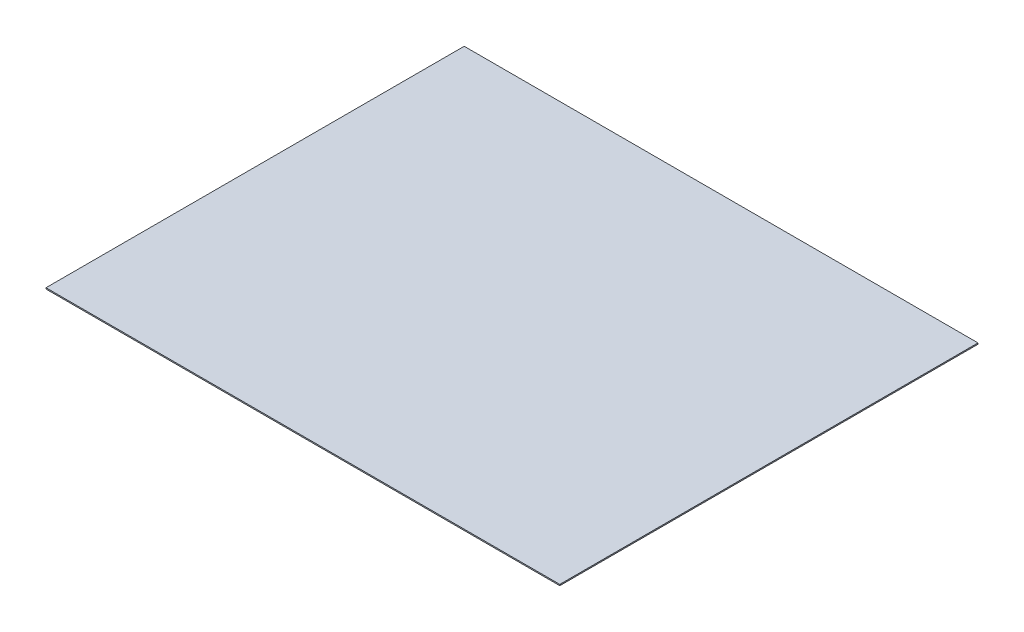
ISO-10303-21;
HEADER;
FILE_DESCRIPTION(('STEP AP214'),'2;1');
FILE_NAME('part.step','',(''),(''),'','','');
FILE_SCHEMA(('AUTOMOTIVE_DESIGN { 1 0 10303 214 1 1 1 1 }'));
ENDSEC;
DATA;
#1=APPLICATION_CONTEXT('core data for automotive mechanical design processes');
#2=APPLICATION_PROTOCOL_DEFINITION('international standard','automotive_design',2000,#1);
#3=PRODUCT_CONTEXT('',#1,'mechanical');
#4=PRODUCT('Part','Part','',(#3));
#5=PRODUCT_RELATED_PRODUCT_CATEGORY('part','',(#4));
#6=PRODUCT_DEFINITION_FORMATION('','',#4);
#7=PRODUCT_DEFINITION_CONTEXT('part definition',#1,'design');
#8=PRODUCT_DEFINITION('design','',#6,#7);
#9=PRODUCT_DEFINITION_SHAPE('','',#8);
#10=(LENGTH_UNIT() NAMED_UNIT(*) SI_UNIT(.MILLI.,.METRE.));
#11=(NAMED_UNIT(*) PLANE_ANGLE_UNIT() SI_UNIT($,.RADIAN.));
#12=(NAMED_UNIT(*) SI_UNIT($,.STERADIAN.) SOLID_ANGLE_UNIT());
#13=UNCERTAINTY_MEASURE_WITH_UNIT(LENGTH_MEASURE(1.E-05),#10,'distance_accuracy_value','');
#14=(GEOMETRIC_REPRESENTATION_CONTEXT(3) GLOBAL_UNCERTAINTY_ASSIGNED_CONTEXT((#13)) GLOBAL_UNIT_ASSIGNED_CONTEXT((#10,
#11,#12)) REPRESENTATION_CONTEXT('',''));
#15=CARTESIAN_POINT('',(0.,0.,0.));
#16=DIRECTION('',(0.,0.,1.));
#17=DIRECTION('',(1.,0.,0.));
#18=AXIS2_PLACEMENT_3D('',#15,#16,#17);
#19=CARTESIAN_POINT('',(0.,1.27,0.));
#20=DIRECTION('',(1.,0.,0.));
#21=DIRECTION('',(0.,0.,-1.));
#22=AXIS2_PLACEMENT_3D('',#19,#20,#21);
#23=PLANE('',#22);
#24=DIRECTION('',(0.,0.,1.));
#25=VECTOR('',#24,1.);
#26=CARTESIAN_POINT('',(0.,0.,0.));
#27=LINE('',#26,#25);
#28=CARTESIAN_POINT('',(0.,0.,0.));
#29=VERTEX_POINT('',#28);
#30=CARTESIAN_POINT('',(0.,0.,444.5));
#31=VERTEX_POINT('',#30);
#32=EDGE_CURVE('E100',#29,#31,#27,.T.);
#33=ORIENTED_EDGE('',*,*,#32,.T.);
#34=DIRECTION('',(0.,-1.,0.));
#35=VECTOR('',#34,1.);
#36=CARTESIAN_POINT('',(0.,1.27,444.5));
#37=LINE('',#36,#35);
#38=CARTESIAN_POINT('',(0.,1.27,444.5));
#39=VERTEX_POINT('',#38);
#40=EDGE_CURVE('E11',#39,#31,#37,.T.);
#41=ORIENTED_EDGE('',*,*,#40,.F.);
#42=DIRECTION('',(0.,0.,1.));
#43=VECTOR('',#42,1.);
#44=CARTESIAN_POINT('',(0.,1.27,0.));
#45=LINE('',#44,#43);
#46=CARTESIAN_POINT('',(0.,1.27,0.));
#47=VERTEX_POINT('',#46);
#48=EDGE_CURVE('E88',#47,#39,#45,.T.);
#49=ORIENTED_EDGE('',*,*,#48,.F.);
#50=DIRECTION('',(0.,-1.,0.));
#51=VECTOR('',#50,1.);
#52=CARTESIAN_POINT('',(0.,1.27,0.));
#53=LINE('',#52,#51);
#54=EDGE_CURVE('E96',#47,#29,#53,.T.);
#55=ORIENTED_EDGE('',*,*,#54,.T.);
#56=EDGE_LOOP('',(#33,#41,#49,#55));
#57=FACE_BOUND('',#56,.T.);
#58=ADVANCED_FACE('F37',(#57),#23,.F.);
#59=CARTESIAN_POINT('',(0.,1.27,444.5));
#60=DIRECTION('',(0.,0.,-1.));
#61=DIRECTION('',(-1.,0.,0.));
#62=AXIS2_PLACEMENT_3D('',#59,#60,#61);
#63=PLANE('',#62);
#64=DIRECTION('',(1.,0.,0.));
#65=VECTOR('',#64,1.);
#66=CARTESIAN_POINT('',(0.,0.,444.5));
#67=LINE('',#66,#65);
#68=CARTESIAN_POINT('',(546.1,0.,444.5));
#69=VERTEX_POINT('',#68);
#70=EDGE_CURVE('E92',#31,#69,#67,.T.);
#71=ORIENTED_EDGE('',*,*,#70,.T.);
#72=DIRECTION('',(0.,-1.,0.));
#73=VECTOR('',#72,1.);
#74=CARTESIAN_POINT('',(546.1,1.27,444.5));
#75=LINE('',#74,#73);
#76=CARTESIAN_POINT('',(546.1,1.27,444.5));
#77=VERTEX_POINT('',#76);
#78=EDGE_CURVE('E45',#77,#69,#75,.T.);
#79=ORIENTED_EDGE('',*,*,#78,.F.);
#80=DIRECTION('',(1.,0.,0.));
#81=VECTOR('',#80,1.);
#82=CARTESIAN_POINT('',(0.,1.27,444.5));
#83=LINE('',#82,#81);
#84=EDGE_CURVE('E83',#39,#77,#83,.T.);
#85=ORIENTED_EDGE('',*,*,#84,.F.);
#86=ORIENTED_EDGE('',*,*,#40,.T.);
#87=EDGE_LOOP('',(#71,#79,#85,#86));
#88=FACE_BOUND('',#87,.T.);
#89=ADVANCED_FACE('F91',(#88),#63,.F.);
#90=CARTESIAN_POINT('',(546.1,1.27,0.));
#91=DIRECTION('',(-1.,0.,0.));
#92=DIRECTION('',(0.,0.,1.));
#93=AXIS2_PLACEMENT_3D('',#90,#91,#92);
#94=PLANE('',#93);
#95=DIRECTION('',(0.,0.,-1.));
#96=VECTOR('',#95,1.);
#97=CARTESIAN_POINT('',(546.1,0.,0.));
#98=LINE('',#97,#96);
#99=CARTESIAN_POINT('',(546.1,0.,0.));
#100=VERTEX_POINT('',#99);
#101=EDGE_CURVE('E70',#69,#100,#98,.T.);
#102=ORIENTED_EDGE('',*,*,#101,.T.);
#103=DIRECTION('',(0.,-1.,0.));
#104=VECTOR('',#103,1.);
#105=CARTESIAN_POINT('',(546.1,1.27,0.));
#106=LINE('',#105,#104);
#107=CARTESIAN_POINT('',(546.1,1.27,0.));
#108=VERTEX_POINT('',#107);
#109=EDGE_CURVE('E93',#108,#100,#106,.T.);
#110=ORIENTED_EDGE('',*,*,#109,.F.);
#111=DIRECTION('',(0.,0.,-1.));
#112=VECTOR('',#111,1.);
#113=CARTESIAN_POINT('',(546.1,1.27,0.));
#114=LINE('',#113,#112);
#115=EDGE_CURVE('E86',#77,#108,#114,.T.);
#116=ORIENTED_EDGE('',*,*,#115,.F.);
#117=ORIENTED_EDGE('',*,*,#78,.T.);
#118=EDGE_LOOP('',(#102,#110,#116,#117));
#119=FACE_BOUND('',#118,.T.);
#120=ADVANCED_FACE('F94',(#119),#94,.F.);
#121=CARTESIAN_POINT('',(0.,1.27,0.));
#122=DIRECTION('',(0.,0.,1.));
#123=DIRECTION('',(1.,0.,0.));
#124=AXIS2_PLACEMENT_3D('',#121,#122,#123);
#125=PLANE('',#124);
#126=DIRECTION('',(-1.,0.,0.));
#127=VECTOR('',#126,1.);
#128=CARTESIAN_POINT('',(0.,0.,0.));
#129=LINE('',#128,#127);
#130=EDGE_CURVE('E76',#100,#29,#129,.T.);
#131=ORIENTED_EDGE('',*,*,#130,.T.);
#132=ORIENTED_EDGE('',*,*,#54,.F.);
#133=DIRECTION('',(-1.,0.,0.));
#134=VECTOR('',#133,1.);
#135=CARTESIAN_POINT('',(0.,1.27,0.));
#136=LINE('',#135,#134);
#137=EDGE_CURVE('E53',#108,#47,#136,.T.);
#138=ORIENTED_EDGE('',*,*,#137,.F.);
#139=ORIENTED_EDGE('',*,*,#109,.T.);
#140=EDGE_LOOP('',(#131,#132,#138,#139));
#141=FACE_BOUND('',#140,.T.);
#142=ADVANCED_FACE('F107',(#141),#125,.F.);
#143=CARTESIAN_POINT('',(0.,1.27,0.));
#144=DIRECTION('',(0.,1.,0.));
#145=DIRECTION('',(0.,0.,1.));
#146=AXIS2_PLACEMENT_3D('',#143,#144,#145);
#147=PLANE('',#146);
#148=ORIENTED_EDGE('',*,*,#48,.T.);
#149=ORIENTED_EDGE('',*,*,#84,.T.);
#150=ORIENTED_EDGE('',*,*,#115,.T.);
#151=ORIENTED_EDGE('',*,*,#137,.T.);
#152=EDGE_LOOP('',(#148,#149,#150,#151));
#153=FACE_BOUND('',#152,.T.);
#154=ADVANCED_FACE('F84',(#153),#147,.T.);
#155=CARTESIAN_POINT('',(0.,0.,0.));
#156=DIRECTION('',(0.,1.,0.));
#157=DIRECTION('',(0.,0.,1.));
#158=AXIS2_PLACEMENT_3D('',#155,#156,#157);
#159=PLANE('',#158);
#160=ORIENTED_EDGE('',*,*,#32,.F.);
#161=ORIENTED_EDGE('',*,*,#130,.F.);
#162=ORIENTED_EDGE('',*,*,#101,.F.);
#163=ORIENTED_EDGE('',*,*,#70,.F.);
#164=EDGE_LOOP('',(#160,#161,#162,#163));
#165=FACE_BOUND('',#164,.T.);
#166=ADVANCED_FACE('F110',(#165),#159,.F.);
#167=CLOSED_SHELL('',(#58,#89,#120,#142,#154,#166));
#168=MANIFOLD_SOLID_BREP('B2',#167);
#169=ADVANCED_BREP_SHAPE_REPRESENTATION('',(#18,#168),#14);
#170=SHAPE_DEFINITION_REPRESENTATION(#9,#169);
ENDSEC;
END-ISO-10303-21;
